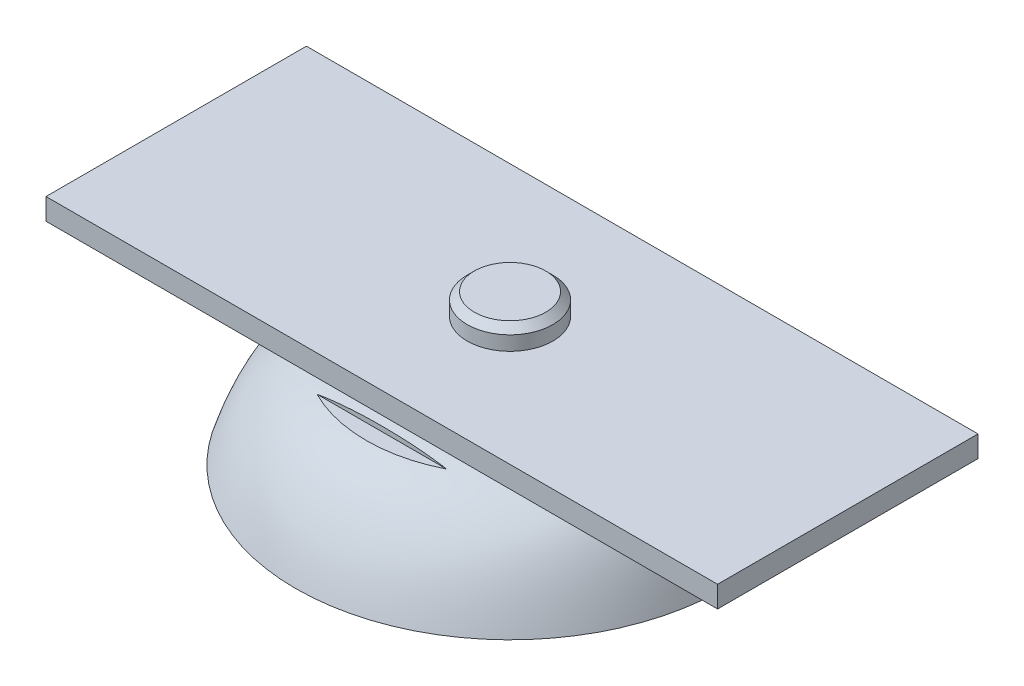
from build123d import *

# Parameters (mm, degrees)
BOSS_EXTRUDE1_DEPTH = 3
CUT_EXTRUDE1_DEPTH  = 58.221062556
SKETCH4_R           = 6
BOSS_EXTRUDE2_DEPTH = 3
CHAMFER1_SIZE       = 1
SKETCH5_W           = 111.338418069
SKETCH5_H           = 78.387795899
SKETCH5_W_2         = 94
SKETCH5_H_2         = 36.449417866
CUT_EXTRUDE2_DEPTH  = 5


with BuildPart() as part:
    # Sketch1 → Boss-Extrude1 (new body)
    with BuildSketch(Plane(origin=(0, 0, 0), x_dir=(1, 0, 0), z_dir=(0, 1, 0))):
        with BuildLine():
            Line((42, -32.5), (-42, -32.5))
            ThreePointArc((-42, -32.5), (-45.535533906, -31.035533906), (-47, -27.5))
            Line((-47, -27.5), (-47, 27.5))
            ThreePointArc((-47, 27.5), (-45.535533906, 31.035533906), (-42, 32.5))
            Line((-42, 32.5), (42, 32.5))
            ThreePointArc((42, 32.5), (45.535533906, 31.035533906), (47, 27.5))
            Line((47, 27.5), (47, -27.5))
            ThreePointArc((47, -27.5), (45.535533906, -31.035533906), (42, -32.5))
        make_face()
    extrude(amount=BOSS_EXTRUDE1_DEPTH)

    # Sketch2 → Cut-Extrude1 (cut, through all)
    with BuildSketch(Plane(origin=(0, 3, 0), x_dir=(1, 0, 0), z_dir=(0, 1, 0))):
        with BuildLine():
            Line((-39, 26.5), (-35, 26.5))
            ThreePointArc((-35, 26.5), (-31, 22.5), (-35, 18.5))
            Line((-35, 18.5), (-39, 18.5))
            ThreePointArc((-39, 18.5), (-43, 22.5), (-39, 26.5))
        make_face()
        with BuildLine():
            Line((39, 26.5), (35, 26.5))
            ThreePointArc((35, 26.5), (31, 22.5), (35, 18.5))
            Line((35, 18.5), (39, 18.5))
            ThreePointArc((39, 18.5), (43, 22.5), (39, 26.5))
        make_face()
        with BuildLine():
            Line((-39, -26.5), (-35, -26.5))
            ThreePointArc((-35, -26.5), (-31, -22.5), (-35, -18.5))
            Line((-35, -18.5), (-39, -18.5))
            ThreePointArc((-39, -18.5), (-43, -22.5), (-39, -26.5))
        make_face()
        with BuildLine():
            Line((39, -26.5), (35, -26.5))
            ThreePointArc((35, -26.5), (31, -22.5), (35, -18.5))
            Line((35, -18.5), (39, -18.5))
            ThreePointArc((39, -18.5), (43, -22.5), (39, -26.5))
        make_face()
    extrude(amount=-CUT_EXTRUDE1_DEPTH, mode=Mode.SUBTRACT)

    # Sketch4 → Boss-Extrude2 (add)
    with BuildSketch(Plane(origin=(0, 3, 0), x_dir=(1, 0, 0), z_dir=(0, 1, 0))):
        with Locations(Location((0, 0, 0), (0, 0, 270))):
            Circle(SKETCH4_R)
    extrude(amount=BOSS_EXTRUDE2_DEPTH)

    # Chamfer1
    chamfer1_edges = [part.edges().sort_by_distance(p)[0] for p in [
        (0, 6, -6),
    ]]
    chamfer(chamfer1_edges, length=CHAMFER1_SIZE)


with BuildPart() as body_2:
    # Sketch3 → Revolve1 (revolve)
    with BuildSketch(Plane.XY, mode=Mode.PRIVATE) as revolve1_sk:
        with BuildLine():
            Line((-30, -15), (-29.047609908, -15.304882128))
            add(Edge.make_bspline(
                [(0, -1), (-0.634970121, -1), (-1.927483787, -1.003111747), (-4.331871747, -1.02423995), (-7.131597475, -1.08317924), (-10.143047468, -1.22040905), (-13.73501387, -1.510478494), (-17.474492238, -2.107450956), (-20.924992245, -3.287407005), (-23.557460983, -5.00265737), (-25.312832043, -7.010318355), (-26.557667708, -9.072790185), (-27.427205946, -10.865239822), (-28.115311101, -12.583067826), (-28.648775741, -14.085031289), (-28.918813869, -14.902549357), (-29.047609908, -15.304882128)],
                knots=[0, 0, 0, 0, 0.03125, 0.0625, 0.125, 0.1875, 0.25, 0.375, 0.5, 0.625, 0.75, 0.8125, 0.875, 0.9375, 0.96875, 1, 1, 1, 1], degree=3))
            Line((0, -1), (0, 0))
            add(Edge.make_bspline(
                [(0, 0), (-20.874020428, 0), (-25.709367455, -1.596931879), (-30, -15)],
                knots=[0, 0, 0, 0, 1, 1, 1, 1], degree=3))
        make_face()
    revolve(revolve1_sk.sketch.rotate(Axis((0, 0, 0), (0, -1, 0)), 270), axis=Axis((0, 0, 0), (0, -1, 0)))


with BuildPart() as cut_extrude2_tool:
    # Sketch5 → Cut-Extrude2 (new body)
    with BuildSketch(Plane(origin=(0, 3, 0), x_dir=(1, 0, 0), z_dir=(0, 1, 0))):
        with Locations((1.820955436, -0.26013649)):
            Rectangle(SKETCH5_W, SKETCH5_H)
        with Locations((0, 0.275291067)):
            Rectangle(SKETCH5_W_2, SKETCH5_H_2, mode=Mode.SUBTRACT)
    extrude(amount=-CUT_EXTRUDE2_DEPTH)


with BuildPart() as part_1:
    add(part.part)

    # Cut-Extrude2: cut by cut_extrude2_tool
    add(cut_extrude2_tool.part, mode=Mode.SUBTRACT)


with BuildPart() as body_2_1:
    add(body_2.part)

    # Cut-Extrude2: cut by cut_extrude2_tool
    add(cut_extrude2_tool.part, mode=Mode.SUBTRACT)


solid = Compound([part_1.part, body_2_1.part])
